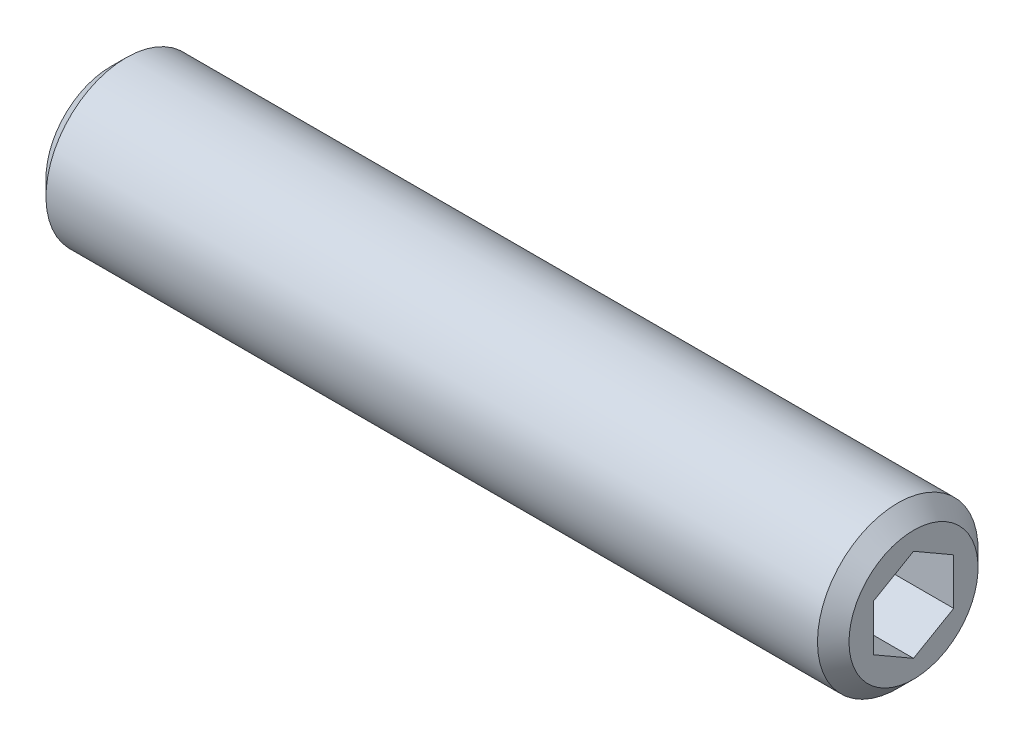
ISO-10303-21;
HEADER;
FILE_DESCRIPTION(('STEP AP214'),'2;1');
FILE_NAME('part.step','',(''),(''),'','','');
FILE_SCHEMA(('AUTOMOTIVE_DESIGN { 1 0 10303 214 1 1 1 1 }'));
ENDSEC;
DATA;
#1=APPLICATION_CONTEXT('core data for automotive mechanical design processes');
#2=APPLICATION_PROTOCOL_DEFINITION('international standard','automotive_design',2000,#1);
#3=PRODUCT_CONTEXT('',#1,'mechanical');
#4=PRODUCT('Part','Part','',(#3));
#5=PRODUCT_RELATED_PRODUCT_CATEGORY('part','',(#4));
#6=PRODUCT_DEFINITION_FORMATION('','',#4);
#7=PRODUCT_DEFINITION_CONTEXT('part definition',#1,'design');
#8=PRODUCT_DEFINITION('design','',#6,#7);
#9=PRODUCT_DEFINITION_SHAPE('','',#8);
#10=(LENGTH_UNIT() NAMED_UNIT(*) SI_UNIT(.MILLI.,.METRE.));
#11=(NAMED_UNIT(*) PLANE_ANGLE_UNIT() SI_UNIT($,.RADIAN.));
#12=(NAMED_UNIT(*) SI_UNIT($,.STERADIAN.) SOLID_ANGLE_UNIT());
#13=UNCERTAINTY_MEASURE_WITH_UNIT(LENGTH_MEASURE(1.E-05),#10,'distance_accuracy_value','');
#14=(GEOMETRIC_REPRESENTATION_CONTEXT(3) GLOBAL_UNCERTAINTY_ASSIGNED_CONTEXT((#13)) GLOBAL_UNIT_ASSIGNED_CONTEXT((#10,
#11,#12)) REPRESENTATION_CONTEXT('',''));
#15=CARTESIAN_POINT('',(0.,0.,0.));
#16=DIRECTION('',(0.,0.,1.));
#17=DIRECTION('',(1.,0.,0.));
#18=AXIS2_PLACEMENT_3D('',#15,#16,#17);
#19=CARTESIAN_POINT('',(25.,-0.721687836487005,-1.25000000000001));
#20=DIRECTION('',(0.,0.,-1.));
#21=DIRECTION('',(-1.,0.,0.));
#22=AXIS2_PLACEMENT_3D('',#19,#20,#21);
#23=PLANE('',#22);
#24=DIRECTION('',(1.,0.,0.));
#25=VECTOR('',#24,1.);
#26=CARTESIAN_POINT('',(25.,-0.721687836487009,-1.25000000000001));
#27=LINE('',#26,#25);
#28=CARTESIAN_POINT('',(22.0000000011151,-0.721687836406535,-1.24999999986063));
#29=VERTEX_POINT('',#28);
#30=CARTESIAN_POINT('',(25.,-0.721687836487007,-1.25000000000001));
#31=VERTEX_POINT('',#30);
#32=EDGE_CURVE('E87',#29,#31,#27,.T.);
#33=ORIENTED_EDGE('',*,*,#32,.T.);
#34=DIRECTION('',(0.,1.,0.));
#35=VECTOR('',#34,1.);
#36=CARTESIAN_POINT('',(25.,-0.721687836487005,-1.25000000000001));
#37=LINE('',#36,#35);
#38=CARTESIAN_POINT('',(25.,0.721687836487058,-1.24999999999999));
#39=VERTEX_POINT('',#38);
#40=EDGE_CURVE('E94',#39,#31,#37,.F.);
#41=ORIENTED_EDGE('',*,*,#40,.F.);
#42=DIRECTION('',(1.,0.,0.));
#43=VECTOR('',#42,1.);
#44=CARTESIAN_POINT('',(25.,0.721687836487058,-1.24999999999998));
#45=LINE('',#44,#43);
#46=CARTESIAN_POINT('',(22.0000000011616,0.721687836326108,-1.25));
#47=VERTEX_POINT('',#46);
#48=EDGE_CURVE('E90',#39,#47,#45,.F.);
#49=ORIENTED_EDGE('',*,*,#48,.T.);
#50=CARTESIAN_POINT('',(22.0000000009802,-0.721687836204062,-1.25000000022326));
#51=CARTESIAN_POINT('',(21.981684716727,-0.658260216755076,-1.25000000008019));
#52=CARTESIAN_POINT('',(21.9650279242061,-0.594285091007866,-1.2500000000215));
#53=CARTESIAN_POINT('',(21.9359539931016,-0.465227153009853,-1.24999999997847));
#54=CARTESIAN_POINT('',(21.9235471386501,-0.400142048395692,-1.24999999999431));
#55=CARTESIAN_POINT('',(21.9042349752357,-0.27077840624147,-1.25000000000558));
#56=CARTESIAN_POINT('',(21.8972011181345,-0.206519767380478,-1.2500000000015));
#57=CARTESIAN_POINT('',(21.8888057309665,-0.0777002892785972,-1.24999999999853));
#58=CARTESIAN_POINT('',(21.8874372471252,-0.0131399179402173,-1.24999999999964));
#59=CARTESIAN_POINT('',(21.8902914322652,0.107484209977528,-1.25000000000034));
#60=CARTESIAN_POINT('',(21.8938133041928,0.163566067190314,-1.2500000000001));
#61=CARTESIAN_POINT('',(21.9049733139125,0.275364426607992,-1.24999999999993));
#62=CARTESIAN_POINT('',(21.912615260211,0.331080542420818,-1.24999999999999));
#63=CARTESIAN_POINT('',(21.9317186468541,0.443109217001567,-1.25000000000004));
#64=CARTESIAN_POINT('',(21.9432610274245,0.499407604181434,-1.25000000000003));
#65=CARTESIAN_POINT('',(21.9694573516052,0.611164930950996,-1.25));
#66=CARTESIAN_POINT('',(21.9841051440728,0.666625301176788,-1.24999999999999));
#67=CARTESIAN_POINT('',(22.0000000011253,0.721687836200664,-1.25000000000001));
#68=B_SPLINE_CURVE_WITH_KNOTS('',3,(#50,#51,#52,#53,#54,#55,#56,#57,#58,#59,#60,#61,#62,#63,#64,
#65,#66,#67),.UNSPECIFIED.,.F.,.F.,(4,2,2,2,2,2,2,2,4),(0.,0.198135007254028,0.396746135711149,
0.59044225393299,0.783900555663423,0.952317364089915,1.12089012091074,1.29320101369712,
1.46517373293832),.UNSPECIFIED.);
#69=EDGE_CURVE('E20',#29,#47,#68,.T.);
#70=ORIENTED_EDGE('',*,*,#69,.F.);
#71=EDGE_LOOP('',(#33,#41,#49,#70));
#72=FACE_BOUND('',#71,.T.);
#73=ADVANCED_FACE('F16',(#72),#23,.F.);
#74=CARTESIAN_POINT('',(25.,-1.44337567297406,0.));
#75=DIRECTION('',(0.,-0.866025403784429,-0.500000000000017));
#76=DIRECTION('',(0.,0.500000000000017,-0.866025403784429));
#77=AXIS2_PLACEMENT_3D('',#74,#75,#76);
#78=PLANE('',#77);
#79=DIRECTION('',(1.,0.,0.));
#80=VECTOR('',#79,1.);
#81=CARTESIAN_POINT('',(25.,-1.44337567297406,0.));
#82=LINE('',#81,#80);
#83=CARTESIAN_POINT('',(22.0000000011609,-1.44337567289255,-1.41215850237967E-10));
#84=VERTEX_POINT('',#83);
#85=CARTESIAN_POINT('',(25.,-1.44337567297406,0.));
#86=VERTEX_POINT('',#85);
#87=EDGE_CURVE('E166',#84,#86,#82,.T.);
#88=ORIENTED_EDGE('',*,*,#87,.T.);
#89=DIRECTION('',(0.,0.500000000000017,-0.866025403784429));
#90=VECTOR('',#89,1.);
#91=CARTESIAN_POINT('',(25.,-1.44337567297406,0.));
#92=LINE('',#91,#90);
#93=EDGE_CURVE('E105',#31,#86,#92,.F.);
#94=ORIENTED_EDGE('',*,*,#93,.F.);
#95=ORIENTED_EDGE('',*,*,#32,.F.);
#96=CARTESIAN_POINT('',(22.0000000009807,-1.44337567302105,-3.59276312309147E-10));
#97=CARTESIAN_POINT('',(21.9816847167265,-1.41166186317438,-0.054929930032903));
#98=CARTESIAN_POINT('',(21.9650279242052,-1.37967430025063,-0.11033401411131));
#99=CARTESIAN_POINT('',(21.9359539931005,-1.3151453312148,-0.222101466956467));
#100=CARTESIAN_POINT('',(21.9235471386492,-1.2826027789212,-0.278466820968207));
#101=CARTESIAN_POINT('',(21.9042349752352,-1.21792095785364,-0.390499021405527));
#102=CARTESIAN_POINT('',(21.897201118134,-1.18579163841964,-0.446148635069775));
#103=CARTESIAN_POINT('',(21.8888057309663,-1.12138189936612,-0.557709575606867));
#104=CARTESIAN_POINT('',(21.8874372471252,-1.08910171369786,-0.613620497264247));
#105=CARTESIAN_POINT('',(21.8902914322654,-1.02878964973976,-0.718084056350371));
#106=CARTESIAN_POINT('',(21.8938133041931,-1.00074872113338,-0.766652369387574));
#107=CARTESIAN_POINT('',(21.904973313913,-0.944849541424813,-0.863472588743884));
#108=CARTESIAN_POINT('',(21.9126152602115,-0.916991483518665,-0.911724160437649));
#109=CARTESIAN_POINT('',(21.9317186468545,-0.860977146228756,-1.00874383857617));
#110=CARTESIAN_POINT('',(21.9432610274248,-0.832827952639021,-1.05749967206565));
#111=CARTESIAN_POINT('',(21.9694573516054,-0.776949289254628,-1.15428435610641));
#112=CARTESIAN_POINT('',(21.9841051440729,-0.749219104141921,-1.20231444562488));
#113=CARTESIAN_POINT('',(22.0000000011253,-0.721687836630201,-1.24999999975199));
#114=B_SPLINE_CURVE_WITH_KNOTS('',3,(#96,#97,#98,#99,#100,#101,#102,#103,#104,#105,#106,#107,
#108,#109,#110,#111,#112,#113),.UNSPECIFIED.,.F.,.F.,(4,2,2,2,2,2,2,2,4),(0.,0.198135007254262,
0.396746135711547,0.590442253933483,0.783900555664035,0.952317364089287,1.12089012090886,
1.29320101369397,1.46517373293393),.UNSPECIFIED.);
#115=EDGE_CURVE('E96',#84,#29,#114,.T.);
#116=ORIENTED_EDGE('',*,*,#115,.F.);
#117=EDGE_LOOP('',(#88,#94,#95,#116));
#118=FACE_BOUND('',#117,.T.);
#119=ADVANCED_FACE('F106',(#118),#78,.F.);
#120=CARTESIAN_POINT('',(25.,0.721687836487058,-1.24999999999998));
#121=DIRECTION('',(0.,0.866025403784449,-0.499999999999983));
#122=DIRECTION('',(0.,0.499999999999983,0.866025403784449));
#123=AXIS2_PLACEMENT_3D('',#120,#121,#122);
#124=PLANE('',#123);
#125=ORIENTED_EDGE('',*,*,#48,.F.);
#126=DIRECTION('',(0.,0.499999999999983,0.866025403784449));
#127=VECTOR('',#126,1.);
#128=CARTESIAN_POINT('',(25.,0.721687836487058,-1.24999999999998));
#129=LINE('',#128,#127);
#130=CARTESIAN_POINT('',(25.,1.44337567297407,0.));
#131=VERTEX_POINT('',#130);
#132=EDGE_CURVE('E104',#131,#39,#129,.F.);
#133=ORIENTED_EDGE('',*,*,#132,.F.);
#134=DIRECTION('',(1.,0.,0.));
#135=VECTOR('',#134,1.);
#136=CARTESIAN_POINT('',(25.,1.44337567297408,0.));
#137=LINE('',#136,#135);
#138=CARTESIAN_POINT('',(22.0000000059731,1.44337568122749,1.42953539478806E-08));
#139=VERTEX_POINT('',#138);
#140=EDGE_CURVE('E226',#131,#139,#137,.F.);
#141=ORIENTED_EDGE('',*,*,#140,.T.);
#142=CARTESIAN_POINT('',(22.0000000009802,0.721687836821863,-1.24999999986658));
#143=CARTESIAN_POINT('',(21.9816847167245,0.753401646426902,-1.19507007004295));
#144=CARTESIAN_POINT('',(21.9650279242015,0.785389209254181,-1.13966598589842));
#145=CARTESIAN_POINT('',(21.9359539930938,0.849918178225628,-1.02789853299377));
#146=CARTESIAN_POINT('',(21.9235471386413,0.882460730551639,-0.971533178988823));
#147=CARTESIAN_POINT('',(21.9042349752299,0.947142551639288,-0.859500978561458));
#148=CARTESIAN_POINT('',(21.8972011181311,0.9792718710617,-0.803851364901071));
#149=CARTESIAN_POINT('',(21.8888057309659,1.04368161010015,-0.692290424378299));
#150=CARTESIAN_POINT('',(21.8874372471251,1.07596179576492,-0.636379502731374));
#151=CARTESIAN_POINT('',(21.8902914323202,1.13627386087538,-0.531915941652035));
#152=CARTESIAN_POINT('',(21.8938133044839,1.16431479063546,-0.483347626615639));
#153=CARTESIAN_POINT('',(21.9049733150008,1.22021397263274,-0.386527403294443));
#154=CARTESIAN_POINT('',(21.912615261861,1.24807203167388,-0.338275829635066));
#155=CARTESIAN_POINT('',(21.9317186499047,1.3040863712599,-0.241256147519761));
#156=CARTESIAN_POINT('',(21.9432610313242,1.33223556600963,-0.192500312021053));
#157=CARTESIAN_POINT('',(21.9694573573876,1.3881142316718,-0.0957156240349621));
#158=CARTESIAN_POINT('',(21.9841051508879,1.41584441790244,-0.0476855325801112));
#159=CARTESIAN_POINT('',(22.0000000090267,1.44337568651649,2.34561928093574E-08));
#160=B_SPLINE_CURVE_WITH_KNOTS('',3,(#142,#143,#144,#145,#146,#147,#148,#149,#150,#151,#152,
#153,#154,#155,#156,#157,#158,#159),.UNSPECIFIED.,.F.,.F.,(4,2,2,2,2,2,2,2,4),(0.,
0.198135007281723,0.396746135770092,0.590442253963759,0.783900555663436,0.952317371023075,
1.1208901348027,1.29320103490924,1.46517376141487),.UNSPECIFIED.);
#161=EDGE_CURVE('E160',#47,#139,#160,.T.);
#162=ORIENTED_EDGE('',*,*,#161,.F.);
#163=EDGE_LOOP('',(#125,#133,#141,#162));
#164=FACE_BOUND('',#163,.T.);
#165=ADVANCED_FACE('F167',(#164),#124,.F.);
#166=CARTESIAN_POINT('',(25.,-0.721687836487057,1.24999999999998));
#167=DIRECTION('',(0.,-0.866025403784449,0.499999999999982));
#168=DIRECTION('',(0.,-0.499999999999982,-0.866025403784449));
#169=AXIS2_PLACEMENT_3D('',#166,#167,#168);
#170=PLANE('',#169);
#171=DIRECTION('',(1.,0.,0.));
#172=VECTOR('',#171,1.);
#173=CARTESIAN_POINT('',(25.,-0.721687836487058,1.25000000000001));
#174=LINE('',#173,#172);
#175=CARTESIAN_POINT('',(21.9999999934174,-0.721687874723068,1.24999996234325));
#176=VERTEX_POINT('',#175);
#177=CARTESIAN_POINT('',(25.,-0.721687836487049,1.25000000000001));
#178=VERTEX_POINT('',#177);
#179=EDGE_CURVE('E222',#176,#178,#174,.T.);
#180=ORIENTED_EDGE('',*,*,#179,.T.);
#181=DIRECTION('',(0.,-0.499999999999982,-0.866025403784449));
#182=VECTOR('',#181,1.);
#183=CARTESIAN_POINT('',(25.,-0.721687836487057,1.24999999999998));
#184=LINE('',#183,#182);
#185=EDGE_CURVE('E232',#86,#178,#184,.F.);
#186=ORIENTED_EDGE('',*,*,#185,.F.);
#187=ORIENTED_EDGE('',*,*,#87,.F.);
#188=CARTESIAN_POINT('',(22.0000000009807,-1.44337567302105,3.59221077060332E-10));
#189=CARTESIAN_POINT('',(21.9816847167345,-1.41166186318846,0.0549299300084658));
#190=CARTESIAN_POINT('',(21.9650279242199,-1.37967430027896,0.110334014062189));
#191=CARTESIAN_POINT('',(21.9359539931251,-1.31514533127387,0.222101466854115));
#192=CARTESIAN_POINT('',(21.9235471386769,-1.28260277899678,0.27846682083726));
#193=CARTESIAN_POINT('',(21.9042349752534,-1.21792095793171,0.390499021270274));
#194=CARTESIAN_POINT('',(21.8972011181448,-1.18579163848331,0.446148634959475));
#195=CARTESIAN_POINT('',(21.888805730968,-1.12138189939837,0.557709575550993));
#196=CARTESIAN_POINT('',(21.8874372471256,-1.08910171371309,0.613620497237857));
#197=CARTESIAN_POINT('',(21.8902914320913,-1.02878965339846,0.718084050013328));
#198=CARTESIAN_POINT('',(21.8938133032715,-1.00074872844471,0.766652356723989));
#199=CARTESIAN_POINT('',(21.9049733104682,-0.944849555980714,0.863472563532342));
#200=CARTESIAN_POINT('',(21.9126152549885,-0.916991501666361,0.911724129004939));
#201=CARTESIAN_POINT('',(21.9317186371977,-0.860977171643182,1.00874379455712));
#202=CARTESIAN_POINT('',(21.9432610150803,-0.832827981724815,1.05749962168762));
#203=CARTESIAN_POINT('',(21.9694573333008,-0.776949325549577,1.15428429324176));
#204=CARTESIAN_POINT('',(21.9841051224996,-0.74921914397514,1.20231437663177));
#205=CARTESIAN_POINT('',(21.9999999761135,-0.721687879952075,1.24999992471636));
#206=B_SPLINE_CURVE_WITH_KNOTS('',3,(#188,#189,#190,#191,#192,#193,#194,#195,#196,#197,#198,
#199,#200,#201,#202,#203,#204,#205),.UNSPECIFIED.,.F.,.F.,(4,2,2,2,2,2,2,2,4),(0.,
0.198135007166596,0.39674613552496,0.590442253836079,0.783900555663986,0.95231734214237,
1.12089007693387,1.29320094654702,1.46517364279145),.UNSPECIFIED.);
#207=EDGE_CURVE('E99',#84,#176,#206,.T.);
#208=ORIENTED_EDGE('',*,*,#207,.T.);
#209=EDGE_LOOP('',(#180,#186,#187,#208));
#210=FACE_BOUND('',#209,.T.);
#211=ADVANCED_FACE('F170',(#210),#170,.F.);
#212=CARTESIAN_POINT('',(25.,1.44337567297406,0.));
#213=DIRECTION('',(0.,0.866025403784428,0.500000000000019));
#214=DIRECTION('',(0.,-0.500000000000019,0.866025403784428));
#215=AXIS2_PLACEMENT_3D('',#212,#213,#214);
#216=PLANE('',#215);
#217=ORIENTED_EDGE('',*,*,#140,.F.);
#218=DIRECTION('',(0.,-0.500000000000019,0.866025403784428));
#219=VECTOR('',#218,1.);
#220=CARTESIAN_POINT('',(25.,1.44337567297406,0.));
#221=LINE('',#220,#219);
#222=CARTESIAN_POINT('',(25.,0.721687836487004,1.25000000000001));
#223=VERTEX_POINT('',#222);
#224=EDGE_CURVE('E44',#223,#131,#221,.F.);
#225=ORIENTED_EDGE('',*,*,#224,.F.);
#226=DIRECTION('',(1.,0.,0.));
#227=VECTOR('',#226,1.);
#228=CARTESIAN_POINT('',(25.,0.721687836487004,1.25000000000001));
#229=LINE('',#228,#227);
#230=CARTESIAN_POINT('',(21.9999999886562,0.721687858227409,1.24999996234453));
#231=VERTEX_POINT('',#230);
#232=EDGE_CURVE('E132',#223,#231,#229,.F.);
#233=ORIENTED_EDGE('',*,*,#232,.T.);
#234=CARTESIAN_POINT('',(21.9999999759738,0.721687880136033,1.24999992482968));
#235=CARTESIAN_POINT('',(21.981684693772,0.753401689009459,1.19506999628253));
#236=CARTESIAN_POINT('',(21.9650279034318,0.785389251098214,1.13966591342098));
#237=CARTESIAN_POINT('',(21.935953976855,0.849918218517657,1.02789846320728));
#238=CARTESIAN_POINT('',(21.9235471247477,0.882460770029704,0.971533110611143));
#239=CARTESIAN_POINT('',(21.9042349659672,0.947142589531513,0.859500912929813));
#240=CARTESIAN_POINT('',(21.8972011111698,0.979271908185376,0.803851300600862));
#241=CARTESIAN_POINT('',(21.8888057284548,1.04368164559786,0.692290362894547));
#242=CARTESIAN_POINT('',(21.8874372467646,1.07596183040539,0.636379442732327));
#243=CARTESIAN_POINT('',(21.8902914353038,1.13627388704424,0.53191589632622));
#244=CARTESIAN_POINT('',(21.8938133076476,1.164314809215,0.483347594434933));
#245=CARTESIAN_POINT('',(21.9049733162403,1.22021397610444,0.386527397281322));
#246=CARTESIAN_POINT('',(21.9126152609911,1.24807202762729,0.338275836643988));
#247=CARTESIAN_POINT('',(21.9317186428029,1.30408635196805,0.241256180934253));
#248=CARTESIAN_POINT('',(21.9432610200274,1.33223553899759,0.192500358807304));
#249=CARTESIAN_POINT('',(21.9694573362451,1.38811418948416,0.0957156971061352));
#250=CARTESIAN_POINT('',(21.9841051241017,1.41584436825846,0.047685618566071));
#251=CARTESIAN_POINT('',(21.999999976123,1.44337562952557,7.52550370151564E-08));
#252=B_SPLINE_CURVE_WITH_KNOTS('',3,(#234,#235,#236,#237,#238,#239,#240,#241,#242,#243,#244,
#245,#246,#247,#248,#249,#250,#251),.UNSPECIFIED.,.F.,.F.,(4,2,2,2,2,2,2,2,4),(0.,
0.19813500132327,0.396746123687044,0.590442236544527,0.78390053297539,0.952317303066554,
1.12089002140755,1.29320087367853,1.46517355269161),.UNSPECIFIED.);
#253=EDGE_CURVE('E156',#231,#139,#252,.T.);
#254=ORIENTED_EDGE('',*,*,#253,.T.);
#255=EDGE_LOOP('',(#217,#225,#233,#254));
#256=FACE_BOUND('',#255,.T.);
#257=ADVANCED_FACE('F144',(#256),#216,.F.);
#258=CARTESIAN_POINT('',(22.0050000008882,0.,0.));
#259=DIRECTION('',(1.,0.,0.));
#260=DIRECTION('',(0.,0.,-1.));
#261=AXIS2_PLACEMENT_3D('',#258,#259,#260);
#262=CONICAL_SURFACE('',#261,1.45203592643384,1.04719754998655);
#263=CARTESIAN_POINT('',(21.1666666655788,-5.6843418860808E-11,0.));
#264=VERTEX_POINT('',#263);
#265=VERTEX_LOOP('',#264);
#266=FACE_BOUND('',#265,.T.);
#267=ORIENTED_EDGE('',*,*,#207,.F.);
#268=ORIENTED_EDGE('',*,*,#115,.T.);
#269=ORIENTED_EDGE('',*,*,#69,.T.);
#270=ORIENTED_EDGE('',*,*,#161,.T.);
#271=ORIENTED_EDGE('',*,*,#253,.F.);
#272=CARTESIAN_POINT('',(22.0000000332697,0.721687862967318,1.24999996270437));
#273=CARTESIAN_POINT('',(21.9816847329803,0.658260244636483,1.24999998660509));
#274=CARTESIAN_POINT('',(21.9650279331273,0.594285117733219,1.24999999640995));
#275=CARTESIAN_POINT('',(21.9359539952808,0.465227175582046,1.25000000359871));
#276=CARTESIAN_POINT('',(21.9235471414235,0.400142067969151,1.2500000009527));
#277=CARTESIAN_POINT('',(21.9042349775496,0.270778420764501,1.2499999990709));
#278=CARTESIAN_POINT('',(21.8972011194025,0.206519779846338,1.24999999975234));
#279=CARTESIAN_POINT('',(21.8888057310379,0.0777002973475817,1.25000000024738));
#280=CARTESIAN_POINT('',(21.8874372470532,0.0131399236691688,1.25000000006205));
#281=CARTESIAN_POINT('',(21.8902914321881,-0.10748420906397,1.24999999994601));
#282=CARTESIAN_POINT('',(21.8938133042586,-0.163566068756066,1.24999999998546));
#283=CARTESIAN_POINT('',(21.9049733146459,-0.275364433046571,1.25000000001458));
#284=CARTESIAN_POINT('',(21.9126152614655,-0.331080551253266,1.25000000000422));
#285=CARTESIAN_POINT('',(21.9317186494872,-0.443109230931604,1.24999999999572));
#286=CARTESIAN_POINT('',(21.9432610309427,-0.499407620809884,1.24999999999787));
#287=CARTESIAN_POINT('',(21.9694573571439,-0.611164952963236,1.25000000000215));
#288=CARTESIAN_POINT('',(21.9841051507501,-0.666625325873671,1.25000000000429));
#289=CARTESIAN_POINT('',(22.0000000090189,-0.721687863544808,1.25000000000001));
#290=B_SPLINE_CURVE_WITH_KNOTS('',3,(#272,#273,#274,#275,#276,#277,#278,#279,#280,#281,#282,
#283,#284,#285,#286,#287,#288,#289),.UNSPECIFIED.,.F.,.F.,(4,2,2,2,2,2,2,2,4),(0.,
0.198135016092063,0.396746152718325,0.590442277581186,0.783900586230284,0.952317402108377,
1.12089016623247,1.2932010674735,1.46517379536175),.UNSPECIFIED.);
#291=EDGE_CURVE('E125',#231,#176,#290,.T.);
#292=ORIENTED_EDGE('',*,*,#291,.T.);
#293=EDGE_LOOP('',(#267,#268,#269,#270,#271,#292));
#294=FACE_BOUND('',#293,.T.);
#295=ADVANCED_FACE('F97',(#266,#294),#262,.F.);
#296=CARTESIAN_POINT('',(25.,0.721687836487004,1.25000000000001));
#297=DIRECTION('',(0.,0.,1.));
#298=DIRECTION('',(1.,0.,0.));
#299=AXIS2_PLACEMENT_3D('',#296,#297,#298);
#300=PLANE('',#299);
#301=ORIENTED_EDGE('',*,*,#232,.F.);
#302=DIRECTION('',(0.,1.,0.));
#303=VECTOR('',#302,1.);
#304=CARTESIAN_POINT('',(25.,0.,1.25000000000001));
#305=LINE('',#304,#303);
#306=EDGE_CURVE('E124',#223,#178,#305,.F.);
#307=ORIENTED_EDGE('',*,*,#306,.T.);
#308=ORIENTED_EDGE('',*,*,#179,.F.);
#309=ORIENTED_EDGE('',*,*,#291,.F.);
#310=EDGE_LOOP('',(#301,#307,#308,#309));
#311=FACE_BOUND('',#310,.T.);
#312=ADVANCED_FACE('F138',(#311),#300,.F.);
#313=CARTESIAN_POINT('',(25.,0.,0.));
#314=DIRECTION('',(-1.,0.,0.));
#315=DIRECTION('',(0.,0.,1.));
#316=AXIS2_PLACEMENT_3D('',#313,#314,#315);
#317=PLANE('',#316);
#318=ORIENTED_EDGE('',*,*,#224,.T.);
#319=ORIENTED_EDGE('',*,*,#132,.T.);
#320=ORIENTED_EDGE('',*,*,#40,.T.);
#321=ORIENTED_EDGE('',*,*,#93,.T.);
#322=ORIENTED_EDGE('',*,*,#185,.T.);
#323=ORIENTED_EDGE('',*,*,#306,.F.);
#324=EDGE_LOOP('',(#318,#319,#320,#321,#322,#323));
#325=FACE_BOUND('',#324,.T.);
#326=CARTESIAN_POINT('',(25.0000000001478,0.,0.));
#327=DIRECTION('',(-1.,0.,0.));
#328=DIRECTION('',(0.,0.,1.));
#329=AXIS2_PLACEMENT_3D('',#326,#327,#328);
#330=CIRCLE('',#329,2.00924000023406);
#331=CARTESIAN_POINT('',(25.0000000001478,0.,2.00924000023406));
#332=VERTEX_POINT('',#331);
#333=EDGE_CURVE('E120',#332,#332,#330,.T.);
#334=ORIENTED_EDGE('',*,*,#333,.F.);
#335=EDGE_LOOP('',(#334));
#336=FACE_BOUND('',#335,.T.);
#337=ADVANCED_FACE('F197',(#325,#336),#317,.F.);
#338=CARTESIAN_POINT('',(0.,1.25,0.));
#339=DIRECTION('',(-1.,0.,0.));
#340=DIRECTION('',(0.,0.,1.));
#341=AXIS2_PLACEMENT_3D('',#338,#339,#340);
#342=PLANE('',#341);
#343=CARTESIAN_POINT('',(-1.70530365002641E-10,0.,0.));
#344=DIRECTION('',(1.,0.,0.));
#345=DIRECTION('',(0.,1.,0.));
#346=AXIS2_PLACEMENT_3D('',#343,#344,#345);
#347=CIRCLE('',#346,2.00924000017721);
#348=CARTESIAN_POINT('',(-1.70530452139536E-10,2.00924000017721,0.));
#349=VERTEX_POINT('',#348);
#350=EDGE_CURVE('E116',#349,#349,#347,.T.);
#351=ORIENTED_EDGE('',*,*,#350,.F.);
#352=EDGE_LOOP('',(#351));
#353=FACE_BOUND('',#352,.T.);
#354=ADVANCED_FACE('F194',(#353),#342,.T.);
#355=CARTESIAN_POINT('',(24.5092399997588,0.,0.));
#356=DIRECTION('',(-1.,0.,0.));
#357=DIRECTION('',(0.,0.,1.));
#358=AXIS2_PLACEMENT_3D('',#355,#356,#357);
#359=CONICAL_SURFACE('',#358,2.49999999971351,0.78539816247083);
#360=ORIENTED_EDGE('',*,*,#333,.T.);
#361=EDGE_LOOP('',(#360));
#362=FACE_BOUND('',#361,.T.);
#363=CARTESIAN_POINT('',(24.50924,0.,0.));
#364=DIRECTION('',(1.,0.,0.));
#365=DIRECTION('',(0.,1.,0.));
#366=AXIS2_PLACEMENT_3D('',#363,#364,#365);
#367=CIRCLE('',#366,2.5);
#368=CARTESIAN_POINT('',(24.50924,2.5,0.));
#369=VERTEX_POINT('',#368);
#370=EDGE_CURVE('E31',#369,#369,#367,.F.);
#371=ORIENTED_EDGE('',*,*,#370,.F.);
#372=EDGE_LOOP('',(#371));
#373=FACE_BOUND('',#372,.T.);
#374=ADVANCED_FACE('F187',(#362,#373),#359,.T.);
#375=CARTESIAN_POINT('',(0.490760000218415,0.,0.));
#376=DIRECTION('',(1.,0.,0.));
#377=DIRECTION('',(0.,1.,0.));
#378=AXIS2_PLACEMENT_3D('',#375,#376,#377);
#379=CONICAL_SURFACE('',#378,2.49999999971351,0.785398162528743);
#380=CARTESIAN_POINT('',(0.490760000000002,0.,0.));
#381=DIRECTION('',(1.,0.,0.));
#382=DIRECTION('',(0.,1.,0.));
#383=AXIS2_PLACEMENT_3D('',#380,#381,#382);
#384=CIRCLE('',#383,2.5);
#385=CARTESIAN_POINT('',(0.490760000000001,2.5,0.));
#386=VERTEX_POINT('',#385);
#387=EDGE_CURVE('E11',#386,#386,#384,.T.);
#388=ORIENTED_EDGE('',*,*,#387,.F.);
#389=EDGE_LOOP('',(#388));
#390=FACE_BOUND('',#389,.T.);
#391=ORIENTED_EDGE('',*,*,#350,.T.);
#392=EDGE_LOOP('',(#391));
#393=FACE_BOUND('',#392,.T.);
#394=ADVANCED_FACE('F181',(#390,#393),#379,.T.);
#395=CARTESIAN_POINT('',(12.5,0.,0.));
#396=DIRECTION('',(1.,0.,0.));
#397=DIRECTION('',(0.,1.,0.));
#398=AXIS2_PLACEMENT_3D('',#395,#396,#397);
#399=CYLINDRICAL_SURFACE('',#398,2.5);
#400=ORIENTED_EDGE('',*,*,#387,.T.);
#401=EDGE_LOOP('',(#400));
#402=FACE_BOUND('',#401,.T.);
#403=ORIENTED_EDGE('',*,*,#370,.T.);
#404=EDGE_LOOP('',(#403));
#405=FACE_BOUND('',#404,.T.);
#406=ADVANCED_FACE('F179',(#402,#405),#399,.T.);
#407=CLOSED_SHELL('',(#73,#119,#165,#211,#257,#295,#312,#337,#354,#374,#394,#406));
#408=MANIFOLD_SOLID_BREP('B1',#407);
#409=ADVANCED_BREP_SHAPE_REPRESENTATION('',(#18,#408),#14);
#410=SHAPE_DEFINITION_REPRESENTATION(#9,#409);
ENDSEC;
END-ISO-10303-21;
